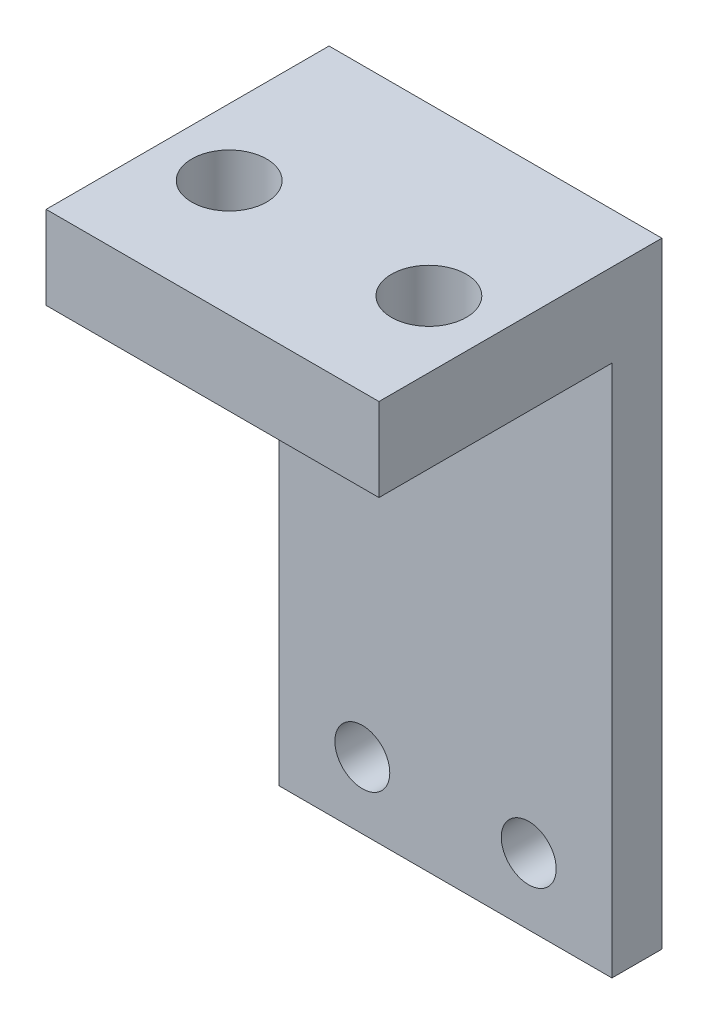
ISO-10303-21;
HEADER;
FILE_DESCRIPTION(('STEP AP214'),'2;1');
FILE_NAME('part.step','',(''),(''),'','','');
FILE_SCHEMA(('AUTOMOTIVE_DESIGN { 1 0 10303 214 1 1 1 1 }'));
ENDSEC;
DATA;
#1=APPLICATION_CONTEXT('core data for automotive mechanical design processes');
#2=APPLICATION_PROTOCOL_DEFINITION('international standard','automotive_design',2000,#1);
#3=PRODUCT_CONTEXT('',#1,'mechanical');
#4=PRODUCT('Part','Part','',(#3));
#5=PRODUCT_RELATED_PRODUCT_CATEGORY('part','',(#4));
#6=PRODUCT_DEFINITION_FORMATION('','',#4);
#7=PRODUCT_DEFINITION_CONTEXT('part definition',#1,'design');
#8=PRODUCT_DEFINITION('design','',#6,#7);
#9=PRODUCT_DEFINITION_SHAPE('','',#8);
#10=(LENGTH_UNIT() NAMED_UNIT(*) SI_UNIT(.MILLI.,.METRE.));
#11=(NAMED_UNIT(*) PLANE_ANGLE_UNIT() SI_UNIT($,.RADIAN.));
#12=(NAMED_UNIT(*) SI_UNIT($,.STERADIAN.) SOLID_ANGLE_UNIT());
#13=UNCERTAINTY_MEASURE_WITH_UNIT(LENGTH_MEASURE(1.E-05),#10,'distance_accuracy_value','');
#14=(GEOMETRIC_REPRESENTATION_CONTEXT(3) GLOBAL_UNCERTAINTY_ASSIGNED_CONTEXT((#13)) GLOBAL_UNIT_ASSIGNED_CONTEXT((#10,
#11,#12)) REPRESENTATION_CONTEXT('',''));
#15=CARTESIAN_POINT('',(0.,0.,0.));
#16=DIRECTION('',(0.,0.,1.));
#17=DIRECTION('',(1.,0.,0.));
#18=AXIS2_PLACEMENT_3D('',#15,#16,#17);
#19=CARTESIAN_POINT('',(-10.,-2.5,17.));
#20=DIRECTION('',(0.,1.,0.));
#21=DIRECTION('',(0.,0.,1.));
#22=AXIS2_PLACEMENT_3D('',#19,#20,#21);
#23=PLANE('',#22);
#24=CARTESIAN_POINT('',(-6.,-2.5,10.));
#25=DIRECTION('',(0.,1.,0.));
#26=DIRECTION('',(0.,0.,1.));
#27=AXIS2_PLACEMENT_3D('',#24,#25,#26);
#28=CIRCLE('',#27,2.25);
#29=CARTESIAN_POINT('',(-6.,-2.5,12.25));
#30=VERTEX_POINT('',#29);
#31=EDGE_CURVE('E203',#30,#30,#28,.T.);
#32=ORIENTED_EDGE('',*,*,#31,.T.);
#33=EDGE_LOOP('',(#32));
#34=FACE_BOUND('',#33,.T.);
#35=CARTESIAN_POINT('',(6.,-2.5,10.));
#36=DIRECTION('',(0.,1.,0.));
#37=DIRECTION('',(0.,0.,1.));
#38=AXIS2_PLACEMENT_3D('',#35,#36,#37);
#39=CIRCLE('',#38,2.25);
#40=CARTESIAN_POINT('',(6.,-2.5,12.25));
#41=VERTEX_POINT('',#40);
#42=EDGE_CURVE('E207',#41,#41,#39,.T.);
#43=ORIENTED_EDGE('',*,*,#42,.T.);
#44=EDGE_LOOP('',(#43));
#45=FACE_BOUND('',#44,.T.);
#46=DIRECTION('',(-1.,0.,0.));
#47=VECTOR('',#46,1.);
#48=CARTESIAN_POINT('',(-10.,-2.5,3.));
#49=LINE('',#48,#47);
#50=CARTESIAN_POINT('',(10.,-2.5,3.));
#51=VERTEX_POINT('',#50);
#52=CARTESIAN_POINT('',(-10.,-2.5,3.));
#53=VERTEX_POINT('',#52);
#54=EDGE_CURVE('E56',#51,#53,#49,.T.);
#55=ORIENTED_EDGE('',*,*,#54,.F.);
#56=DIRECTION('',(0.,0.,-1.));
#57=VECTOR('',#56,1.);
#58=CARTESIAN_POINT('',(10.,-2.5,17.));
#59=LINE('',#58,#57);
#60=CARTESIAN_POINT('',(10.,-2.5,17.));
#61=VERTEX_POINT('',#60);
#62=EDGE_CURVE('E141',#61,#51,#59,.T.);
#63=ORIENTED_EDGE('',*,*,#62,.F.);
#64=DIRECTION('',(1.,0.,0.));
#65=VECTOR('',#64,1.);
#66=CARTESIAN_POINT('',(-10.,-2.5,17.));
#67=LINE('',#66,#65);
#68=CARTESIAN_POINT('',(-10.,-2.5,17.));
#69=VERTEX_POINT('',#68);
#70=EDGE_CURVE('E65',#69,#61,#67,.T.);
#71=ORIENTED_EDGE('',*,*,#70,.F.);
#72=DIRECTION('',(0.,0.,-1.));
#73=VECTOR('',#72,1.);
#74=CARTESIAN_POINT('',(-10.,-2.5,17.));
#75=LINE('',#74,#73);
#76=EDGE_CURVE('E145',#69,#53,#75,.T.);
#77=ORIENTED_EDGE('',*,*,#76,.T.);
#78=EDGE_LOOP('',(#55,#63,#71,#77));
#79=FACE_BOUND('',#78,.T.);
#80=ADVANCED_FACE('F41',(#34,#45,#79),#23,.F.);
#81=CARTESIAN_POINT('',(10.,2.5,17.));
#82=DIRECTION('',(-1.,0.,0.));
#83=DIRECTION('',(0.,0.,1.));
#84=AXIS2_PLACEMENT_3D('',#81,#82,#83);
#85=PLANE('',#84);
#86=DIRECTION('',(0.,1.,0.));
#87=VECTOR('',#86,1.);
#88=CARTESIAN_POINT('',(10.,2.5,0.));
#89=LINE('',#88,#87);
#90=CARTESIAN_POINT('',(10.,-34.5,0.));
#91=VERTEX_POINT('',#90);
#92=CARTESIAN_POINT('',(10.,2.5,0.));
#93=VERTEX_POINT('',#92);
#94=EDGE_CURVE('E114',#91,#93,#89,.T.);
#95=ORIENTED_EDGE('',*,*,#94,.T.);
#96=DIRECTION('',(0.,0.,-1.));
#97=VECTOR('',#96,1.);
#98=CARTESIAN_POINT('',(10.,2.5,17.));
#99=LINE('',#98,#97);
#100=CARTESIAN_POINT('',(10.,2.5,17.));
#101=VERTEX_POINT('',#100);
#102=EDGE_CURVE('E11',#101,#93,#99,.T.);
#103=ORIENTED_EDGE('',*,*,#102,.F.);
#104=DIRECTION('',(0.,1.,0.));
#105=VECTOR('',#104,1.);
#106=CARTESIAN_POINT('',(10.,2.5,17.));
#107=LINE('',#106,#105);
#108=EDGE_CURVE('E108',#61,#101,#107,.T.);
#109=ORIENTED_EDGE('',*,*,#108,.F.);
#110=ORIENTED_EDGE('',*,*,#62,.T.);
#111=DIRECTION('',(0.,1.,0.));
#112=VECTOR('',#111,1.);
#113=CARTESIAN_POINT('',(10.,-34.5,3.));
#114=LINE('',#113,#112);
#115=CARTESIAN_POINT('',(10.,-34.5,3.));
#116=VERTEX_POINT('',#115);
#117=EDGE_CURVE('E133',#116,#51,#114,.T.);
#118=ORIENTED_EDGE('',*,*,#117,.F.);
#119=DIRECTION('',(0.,0.,1.));
#120=VECTOR('',#119,1.);
#121=CARTESIAN_POINT('',(10.,-34.5,0.));
#122=LINE('',#121,#120);
#123=EDGE_CURVE('E117',#91,#116,#122,.T.);
#124=ORIENTED_EDGE('',*,*,#123,.F.);
#125=EDGE_LOOP('',(#95,#103,#109,#110,#118,#124));
#126=FACE_BOUND('',#125,.T.);
#127=ADVANCED_FACE('F43',(#126),#85,.F.);
#128=CARTESIAN_POINT('',(-10.,2.5,17.));
#129=DIRECTION('',(0.,-1.,0.));
#130=DIRECTION('',(0.,0.,-1.));
#131=AXIS2_PLACEMENT_3D('',#128,#129,#130);
#132=PLANE('',#131);
#133=CARTESIAN_POINT('',(-6.,2.5,10.));
#134=DIRECTION('',(0.,1.,0.));
#135=DIRECTION('',(0.,0.,1.));
#136=AXIS2_PLACEMENT_3D('',#133,#134,#135);
#137=CIRCLE('',#136,2.25);
#138=CARTESIAN_POINT('',(-6.,2.5,12.25));
#139=VERTEX_POINT('',#138);
#140=EDGE_CURVE('E201',#139,#139,#137,.T.);
#141=ORIENTED_EDGE('',*,*,#140,.F.);
#142=EDGE_LOOP('',(#141));
#143=FACE_BOUND('',#142,.T.);
#144=CARTESIAN_POINT('',(6.,2.5,10.));
#145=DIRECTION('',(0.,1.,0.));
#146=DIRECTION('',(0.,0.,1.));
#147=AXIS2_PLACEMENT_3D('',#144,#145,#146);
#148=CIRCLE('',#147,2.25);
#149=CARTESIAN_POINT('',(6.,2.5,12.25));
#150=VERTEX_POINT('',#149);
#151=EDGE_CURVE('E204',#150,#150,#148,.T.);
#152=ORIENTED_EDGE('',*,*,#151,.F.);
#153=EDGE_LOOP('',(#152));
#154=FACE_BOUND('',#153,.T.);
#155=DIRECTION('',(-1.,0.,0.));
#156=VECTOR('',#155,1.);
#157=CARTESIAN_POINT('',(-10.,2.5,0.));
#158=LINE('',#157,#156);
#159=CARTESIAN_POINT('',(-10.,2.5,0.));
#160=VERTEX_POINT('',#159);
#161=EDGE_CURVE('E78',#93,#160,#158,.T.);
#162=ORIENTED_EDGE('',*,*,#161,.T.);
#163=DIRECTION('',(0.,0.,-1.));
#164=VECTOR('',#163,1.);
#165=CARTESIAN_POINT('',(-10.,2.5,17.));
#166=LINE('',#165,#164);
#167=CARTESIAN_POINT('',(-10.,2.5,17.));
#168=VERTEX_POINT('',#167);
#169=EDGE_CURVE('E49',#168,#160,#166,.T.);
#170=ORIENTED_EDGE('',*,*,#169,.F.);
#171=DIRECTION('',(-1.,0.,0.));
#172=VECTOR('',#171,1.);
#173=CARTESIAN_POINT('',(-10.,2.5,17.));
#174=LINE('',#173,#172);
#175=EDGE_CURVE('E83',#101,#168,#174,.T.);
#176=ORIENTED_EDGE('',*,*,#175,.F.);
#177=ORIENTED_EDGE('',*,*,#102,.T.);
#178=EDGE_LOOP('',(#162,#170,#176,#177));
#179=FACE_BOUND('',#178,.T.);
#180=ADVANCED_FACE('F154',(#143,#154,#179),#132,.F.);
#181=CARTESIAN_POINT('',(-10.,2.5,17.));
#182=DIRECTION('',(1.,0.,0.));
#183=DIRECTION('',(0.,1.,0.));
#184=AXIS2_PLACEMENT_3D('',#181,#182,#183);
#185=PLANE('',#184);
#186=DIRECTION('',(0.,-1.,0.));
#187=VECTOR('',#186,1.);
#188=CARTESIAN_POINT('',(-10.,2.5,0.));
#189=LINE('',#188,#187);
#190=CARTESIAN_POINT('',(-10.,-34.5,0.));
#191=VERTEX_POINT('',#190);
#192=EDGE_CURVE('E100',#160,#191,#189,.T.);
#193=ORIENTED_EDGE('',*,*,#192,.T.);
#194=DIRECTION('',(0.,0.,-1.));
#195=VECTOR('',#194,1.);
#196=CARTESIAN_POINT('',(-10.,-34.5,0.));
#197=LINE('',#196,#195);
#198=CARTESIAN_POINT('',(-10.,-34.5,3.));
#199=VERTEX_POINT('',#198);
#200=EDGE_CURVE('E105',#199,#191,#197,.T.);
#201=ORIENTED_EDGE('',*,*,#200,.F.);
#202=DIRECTION('',(0.,1.,0.));
#203=VECTOR('',#202,1.);
#204=CARTESIAN_POINT('',(-10.,-34.5,3.));
#205=LINE('',#204,#203);
#206=EDGE_CURVE('E130',#199,#53,#205,.T.);
#207=ORIENTED_EDGE('',*,*,#206,.T.);
#208=ORIENTED_EDGE('',*,*,#76,.F.);
#209=DIRECTION('',(0.,-1.,0.));
#210=VECTOR('',#209,1.);
#211=CARTESIAN_POINT('',(-10.,2.5,17.));
#212=LINE('',#211,#210);
#213=EDGE_CURVE('E138',#168,#69,#212,.T.);
#214=ORIENTED_EDGE('',*,*,#213,.F.);
#215=ORIENTED_EDGE('',*,*,#169,.T.);
#216=EDGE_LOOP('',(#193,#201,#207,#208,#214,#215));
#217=FACE_BOUND('',#216,.T.);
#218=ADVANCED_FACE('F102',(#217),#185,.F.);
#219=CARTESIAN_POINT('',(0.,0.,17.));
#220=DIRECTION('',(0.,0.,1.));
#221=DIRECTION('',(1.,0.,0.));
#222=AXIS2_PLACEMENT_3D('',#219,#220,#221);
#223=PLANE('',#222);
#224=ORIENTED_EDGE('',*,*,#108,.T.);
#225=ORIENTED_EDGE('',*,*,#175,.T.);
#226=ORIENTED_EDGE('',*,*,#213,.T.);
#227=ORIENTED_EDGE('',*,*,#70,.T.);
#228=EDGE_LOOP('',(#224,#225,#226,#227));
#229=FACE_BOUND('',#228,.T.);
#230=ADVANCED_FACE('F153',(#229),#223,.T.);
#231=CARTESIAN_POINT('',(0.,0.,0.));
#232=DIRECTION('',(0.,0.,1.));
#233=DIRECTION('',(1.,0.,0.));
#234=AXIS2_PLACEMENT_3D('',#231,#232,#233);
#235=PLANE('',#234);
#236=CARTESIAN_POINT('',(-5.,-30.5,0.));
#237=DIRECTION('',(0.,0.,1.));
#238=DIRECTION('',(1.,0.,0.));
#239=AXIS2_PLACEMENT_3D('',#236,#237,#238);
#240=CIRCLE('',#239,1.65);
#241=CARTESIAN_POINT('',(-3.35,-30.5,0.));
#242=VERTEX_POINT('',#241);
#243=EDGE_CURVE('E216',#242,#242,#240,.T.);
#244=ORIENTED_EDGE('',*,*,#243,.T.);
#245=EDGE_LOOP('',(#244));
#246=FACE_BOUND('',#245,.T.);
#247=CARTESIAN_POINT('',(5.,-30.5,0.));
#248=DIRECTION('',(0.,0.,1.));
#249=DIRECTION('',(1.,0.,0.));
#250=AXIS2_PLACEMENT_3D('',#247,#248,#249);
#251=CIRCLE('',#250,1.65);
#252=CARTESIAN_POINT('',(6.65,-30.5,0.));
#253=VERTEX_POINT('',#252);
#254=EDGE_CURVE('E124',#253,#253,#251,.T.);
#255=ORIENTED_EDGE('',*,*,#254,.T.);
#256=EDGE_LOOP('',(#255));
#257=FACE_BOUND('',#256,.T.);
#258=ORIENTED_EDGE('',*,*,#94,.F.);
#259=DIRECTION('',(1.,0.,0.));
#260=VECTOR('',#259,1.);
#261=CARTESIAN_POINT('',(-10.,-34.5,0.));
#262=LINE('',#261,#260);
#263=EDGE_CURVE('E111',#191,#91,#262,.T.);
#264=ORIENTED_EDGE('',*,*,#263,.F.);
#265=ORIENTED_EDGE('',*,*,#192,.F.);
#266=ORIENTED_EDGE('',*,*,#161,.F.);
#267=EDGE_LOOP('',(#258,#264,#265,#266));
#268=FACE_BOUND('',#267,.T.);
#269=ADVANCED_FACE('F112',(#246,#257,#268),#235,.F.);
#270=CARTESIAN_POINT('',(-10.,-34.5,3.));
#271=DIRECTION('',(0.,0.,-1.));
#272=DIRECTION('',(-1.,0.,0.));
#273=AXIS2_PLACEMENT_3D('',#270,#271,#272);
#274=PLANE('',#273);
#275=CARTESIAN_POINT('',(-5.,-30.5,3.));
#276=DIRECTION('',(0.,0.,1.));
#277=DIRECTION('',(1.,0.,0.));
#278=AXIS2_PLACEMENT_3D('',#275,#276,#277);
#279=CIRCLE('',#278,1.65);
#280=CARTESIAN_POINT('',(-3.35,-30.5,3.));
#281=VERTEX_POINT('',#280);
#282=EDGE_CURVE('E213',#281,#281,#279,.T.);
#283=ORIENTED_EDGE('',*,*,#282,.F.);
#284=EDGE_LOOP('',(#283));
#285=FACE_BOUND('',#284,.T.);
#286=CARTESIAN_POINT('',(5.,-30.5,3.));
#287=DIRECTION('',(0.,0.,1.));
#288=DIRECTION('',(1.,0.,0.));
#289=AXIS2_PLACEMENT_3D('',#286,#287,#288);
#290=CIRCLE('',#289,1.65);
#291=CARTESIAN_POINT('',(6.65,-30.5,3.));
#292=VERTEX_POINT('',#291);
#293=EDGE_CURVE('E218',#292,#292,#290,.T.);
#294=ORIENTED_EDGE('',*,*,#293,.F.);
#295=EDGE_LOOP('',(#294));
#296=FACE_BOUND('',#295,.T.);
#297=ORIENTED_EDGE('',*,*,#54,.T.);
#298=ORIENTED_EDGE('',*,*,#206,.F.);
#299=DIRECTION('',(-1.,0.,0.));
#300=VECTOR('',#299,1.);
#301=CARTESIAN_POINT('',(-10.,-34.5,3.));
#302=LINE('',#301,#300);
#303=EDGE_CURVE('E121',#116,#199,#302,.T.);
#304=ORIENTED_EDGE('',*,*,#303,.F.);
#305=ORIENTED_EDGE('',*,*,#117,.T.);
#306=EDGE_LOOP('',(#297,#298,#304,#305));
#307=FACE_BOUND('',#306,.T.);
#308=ADVANCED_FACE('F148',(#285,#296,#307),#274,.F.);
#309=CARTESIAN_POINT('',(0.,-34.5,0.));
#310=DIRECTION('',(0.,1.,0.));
#311=DIRECTION('',(0.,0.,1.));
#312=AXIS2_PLACEMENT_3D('',#309,#310,#311);
#313=PLANE('',#312);
#314=ORIENTED_EDGE('',*,*,#200,.T.);
#315=ORIENTED_EDGE('',*,*,#263,.T.);
#316=ORIENTED_EDGE('',*,*,#123,.T.);
#317=ORIENTED_EDGE('',*,*,#303,.T.);
#318=EDGE_LOOP('',(#314,#315,#316,#317));
#319=FACE_BOUND('',#318,.T.);
#320=ADVANCED_FACE('F119',(#319),#313,.F.);
#321=CARTESIAN_POINT('',(5.,-30.5,3.));
#322=DIRECTION('',(0.,0.,1.));
#323=DIRECTION('',(1.,0.,0.));
#324=AXIS2_PLACEMENT_3D('',#321,#322,#323);
#325=CYLINDRICAL_SURFACE('',#324,1.65);
#326=ORIENTED_EDGE('',*,*,#254,.F.);
#327=EDGE_LOOP('',(#326));
#328=FACE_BOUND('',#327,.T.);
#329=ORIENTED_EDGE('',*,*,#293,.T.);
#330=EDGE_LOOP('',(#329));
#331=FACE_BOUND('',#330,.T.);
#332=ADVANCED_FACE('F182',(#328,#331),#325,.F.);
#333=CARTESIAN_POINT('',(-5.,-30.5,3.));
#334=DIRECTION('',(0.,0.,1.));
#335=DIRECTION('',(1.,0.,0.));
#336=AXIS2_PLACEMENT_3D('',#333,#334,#335);
#337=CYLINDRICAL_SURFACE('',#336,1.65);
#338=ORIENTED_EDGE('',*,*,#243,.F.);
#339=EDGE_LOOP('',(#338));
#340=FACE_BOUND('',#339,.T.);
#341=ORIENTED_EDGE('',*,*,#282,.T.);
#342=EDGE_LOOP('',(#341));
#343=FACE_BOUND('',#342,.T.);
#344=ADVANCED_FACE('F185',(#340,#343),#337,.F.);
#345=CARTESIAN_POINT('',(6.,2.5,10.));
#346=DIRECTION('',(0.,1.,0.));
#347=DIRECTION('',(0.,0.,1.));
#348=AXIS2_PLACEMENT_3D('',#345,#346,#347);
#349=CYLINDRICAL_SURFACE('',#348,2.25);
#350=ORIENTED_EDGE('',*,*,#151,.T.);
#351=EDGE_LOOP('',(#350));
#352=FACE_BOUND('',#351,.T.);
#353=ORIENTED_EDGE('',*,*,#42,.F.);
#354=EDGE_LOOP('',(#353));
#355=FACE_BOUND('',#354,.T.);
#356=ADVANCED_FACE('F189',(#352,#355),#349,.F.);
#357=CARTESIAN_POINT('',(-6.,2.5,10.));
#358=DIRECTION('',(0.,1.,0.));
#359=DIRECTION('',(0.,0.,1.));
#360=AXIS2_PLACEMENT_3D('',#357,#358,#359);
#361=CYLINDRICAL_SURFACE('',#360,2.25);
#362=ORIENTED_EDGE('',*,*,#140,.T.);
#363=EDGE_LOOP('',(#362));
#364=FACE_BOUND('',#363,.T.);
#365=ORIENTED_EDGE('',*,*,#31,.F.);
#366=EDGE_LOOP('',(#365));
#367=FACE_BOUND('',#366,.T.);
#368=ADVANCED_FACE('F193',(#364,#367),#361,.F.);
#369=CLOSED_SHELL('',(#80,#127,#180,#218,#230,#269,#308,#320,#332,#344,#356,#368));
#370=MANIFOLD_SOLID_BREP('B2',#369);
#371=ADVANCED_BREP_SHAPE_REPRESENTATION('',(#18,#370),#14);
#372=SHAPE_DEFINITION_REPRESENTATION(#9,#371);
ENDSEC;
END-ISO-10303-21;
